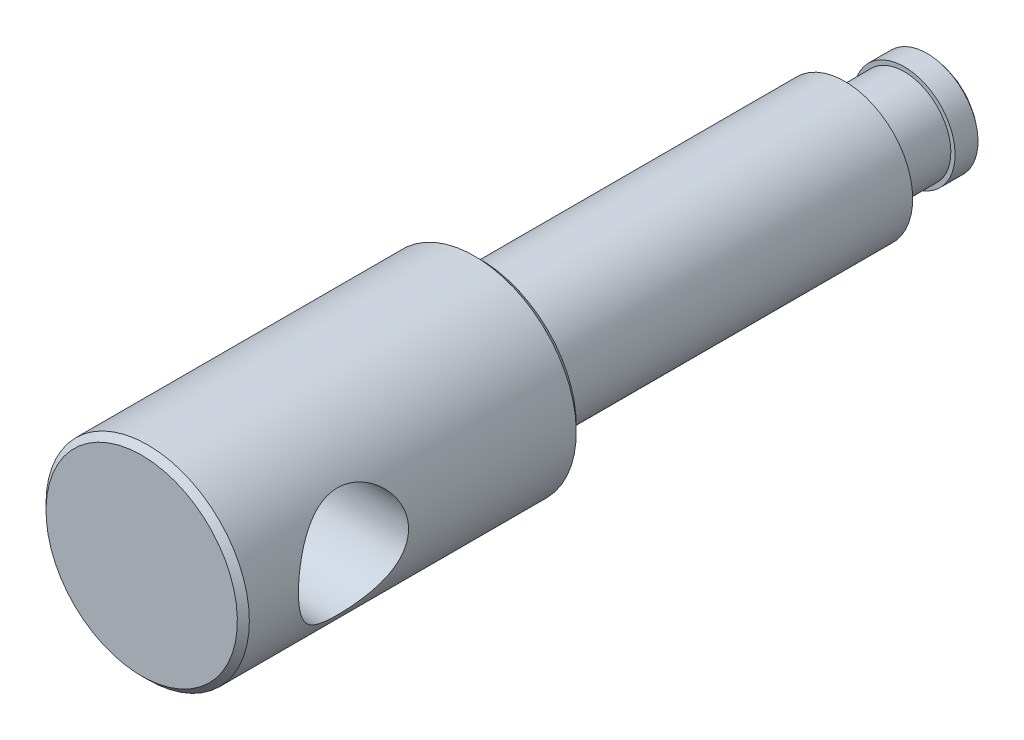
ISO-10303-21;
HEADER;
FILE_DESCRIPTION(('STEP AP214'),'2;1');
FILE_NAME('part.step','',(''),(''),'','','');
FILE_SCHEMA(('AUTOMOTIVE_DESIGN { 1 0 10303 214 1 1 1 1 }'));
ENDSEC;
DATA;
#1=APPLICATION_CONTEXT('core data for automotive mechanical design processes');
#2=APPLICATION_PROTOCOL_DEFINITION('international standard','automotive_design',2000,#1);
#3=PRODUCT_CONTEXT('',#1,'mechanical');
#4=PRODUCT('Part','Part','',(#3));
#5=PRODUCT_RELATED_PRODUCT_CATEGORY('part','',(#4));
#6=PRODUCT_DEFINITION_FORMATION('','',#4);
#7=PRODUCT_DEFINITION_CONTEXT('part definition',#1,'design');
#8=PRODUCT_DEFINITION('design','',#6,#7);
#9=PRODUCT_DEFINITION_SHAPE('','',#8);
#10=(LENGTH_UNIT() NAMED_UNIT(*) SI_UNIT(.MILLI.,.METRE.));
#11=(NAMED_UNIT(*) PLANE_ANGLE_UNIT() SI_UNIT($,.RADIAN.));
#12=(NAMED_UNIT(*) SI_UNIT($,.STERADIAN.) SOLID_ANGLE_UNIT());
#13=UNCERTAINTY_MEASURE_WITH_UNIT(LENGTH_MEASURE(1.E-05),#10,'distance_accuracy_value','');
#14=(GEOMETRIC_REPRESENTATION_CONTEXT(3) GLOBAL_UNCERTAINTY_ASSIGNED_CONTEXT((#13)) GLOBAL_UNIT_ASSIGNED_CONTEXT((#10,
#11,#12)) REPRESENTATION_CONTEXT('',''));
#15=CARTESIAN_POINT('',(0.,0.,0.));
#16=DIRECTION('',(0.,0.,1.));
#17=DIRECTION('',(1.,0.,0.));
#18=AXIS2_PLACEMENT_3D('',#15,#16,#17);
#19=CARTESIAN_POINT('',(0.,0.,9.));
#20=DIRECTION('',(-1.,0.,0.));
#21=DIRECTION('',(0.,1.,0.));
#22=AXIS2_PLACEMENT_3D('',#19,#20,#21);
#23=SPHERICAL_SURFACE('',#22,9.);
#24=CARTESIAN_POINT('',(0.,0.,2.29179606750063));
#25=DIRECTION('',(0.,0.,1.));
#26=DIRECTION('',(0.,-1.,0.));
#27=AXIS2_PLACEMENT_3D('',#24,#25,#26);
#28=CIRCLE('',#27,6.);
#29=CARTESIAN_POINT('',(0.,-6.,2.29179606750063));
#30=VERTEX_POINT('',#29);
#31=EDGE_CURVE('E112',#30,#30,#28,.T.);
#32=ORIENTED_EDGE('',*,*,#31,.F.);
#33=EDGE_LOOP('',(#32));
#34=FACE_BOUND('',#33,.T.);
#35=ADVANCED_FACE('F12',(#34),#23,.T.);
#36=CARTESIAN_POINT('',(0.,0.,0.));
#37=DIRECTION('',(0.,0.,1.));
#38=DIRECTION('',(0.,-1.,0.));
#39=AXIS2_PLACEMENT_3D('',#36,#37,#38);
#40=CYLINDRICAL_SURFACE('',#39,6.);
#41=CARTESIAN_POINT('',(0.,0.,5.));
#42=DIRECTION('',(0.,0.,1.));
#43=DIRECTION('',(0.,-1.,0.));
#44=AXIS2_PLACEMENT_3D('',#41,#42,#43);
#45=CIRCLE('',#44,6.);
#46=CARTESIAN_POINT('',(0.,-6.,5.));
#47=VERTEX_POINT('',#46);
#48=EDGE_CURVE('E113',#47,#47,#45,.F.);
#49=ORIENTED_EDGE('',*,*,#48,.T.);
#50=EDGE_LOOP('',(#49));
#51=FACE_BOUND('',#50,.T.);
#52=ORIENTED_EDGE('',*,*,#31,.T.);
#53=EDGE_LOOP('',(#52));
#54=FACE_BOUND('',#53,.T.);
#55=ADVANCED_FACE('F75',(#51,#54),#40,.T.);
#56=CARTESIAN_POINT('',(5.5,0.,5.));
#57=DIRECTION('',(0.,0.,-1.));
#58=DIRECTION('',(0.,1.,0.));
#59=AXIS2_PLACEMENT_3D('',#56,#57,#58);
#60=PLANE('',#59);
#61=CARTESIAN_POINT('',(0.,0.,5.));
#62=DIRECTION('',(0.,0.,1.));
#63=DIRECTION('',(0.,-1.,0.));
#64=AXIS2_PLACEMENT_3D('',#61,#62,#63);
#65=CIRCLE('',#64,5.5);
#66=CARTESIAN_POINT('',(0.,-5.5,5.));
#67=VERTEX_POINT('',#66);
#68=EDGE_CURVE('E94',#67,#67,#65,.T.);
#69=ORIENTED_EDGE('',*,*,#68,.F.);
#70=EDGE_LOOP('',(#69));
#71=FACE_BOUND('',#70,.T.);
#72=ORIENTED_EDGE('',*,*,#48,.F.);
#73=EDGE_LOOP('',(#72));
#74=FACE_BOUND('',#73,.T.);
#75=ADVANCED_FACE('F71',(#71,#74),#60,.F.);
#76=CARTESIAN_POINT('',(0.,0.,0.));
#77=DIRECTION('',(0.,0.,1.));
#78=DIRECTION('',(0.,-1.,0.));
#79=AXIS2_PLACEMENT_3D('',#76,#77,#78);
#80=CYLINDRICAL_SURFACE('',#79,5.5);
#81=CARTESIAN_POINT('',(0.,0.,10.5566243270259));
#82=DIRECTION('',(0.,0.,1.));
#83=DIRECTION('',(0.,-1.,0.));
#84=AXIS2_PLACEMENT_3D('',#81,#82,#83);
#85=CIRCLE('',#84,5.5);
#86=CARTESIAN_POINT('',(0.,-5.5,10.5566243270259));
#87=VERTEX_POINT('',#86);
#88=EDGE_CURVE('E90',#87,#87,#85,.T.);
#89=ORIENTED_EDGE('',*,*,#88,.F.);
#90=EDGE_LOOP('',(#89));
#91=FACE_BOUND('',#90,.T.);
#92=ORIENTED_EDGE('',*,*,#68,.T.);
#93=EDGE_LOOP('',(#92));
#94=FACE_BOUND('',#93,.T.);
#95=ADVANCED_FACE('F67',(#91,#94),#80,.T.);
#96=CARTESIAN_POINT('',(0.,0.,12.));
#97=DIRECTION('',(0.,0.,1.));
#98=DIRECTION('',(0.,-1.,0.));
#99=AXIS2_PLACEMENT_3D('',#96,#97,#98);
#100=CONICAL_SURFACE('',#99,8.,1.0471975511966);
#101=CARTESIAN_POINT('',(0.,0.,12.));
#102=DIRECTION('',(0.,0.,1.));
#103=DIRECTION('',(0.,-1.,0.));
#104=AXIS2_PLACEMENT_3D('',#101,#102,#103);
#105=CIRCLE('',#104,8.);
#106=CARTESIAN_POINT('',(0.,-8.,12.));
#107=VERTEX_POINT('',#106);
#108=EDGE_CURVE('E97',#107,#107,#105,.T.);
#109=ORIENTED_EDGE('',*,*,#108,.F.);
#110=EDGE_LOOP('',(#109));
#111=FACE_BOUND('',#110,.T.);
#112=ORIENTED_EDGE('',*,*,#88,.T.);
#113=EDGE_LOOP('',(#112));
#114=FACE_BOUND('',#113,.T.);
#115=ADVANCED_FACE('F63',(#111,#114),#100,.T.);
#116=CARTESIAN_POINT('',(0.,0.,0.));
#117=DIRECTION('',(0.,0.,1.));
#118=DIRECTION('',(0.,-1.,0.));
#119=AXIS2_PLACEMENT_3D('',#116,#117,#118);
#120=CYLINDRICAL_SURFACE('',#119,8.);
#121=CARTESIAN_POINT('',(0.,0.,55.));
#122=DIRECTION('',(0.,0.,1.));
#123=DIRECTION('',(0.,-1.,0.));
#124=AXIS2_PLACEMENT_3D('',#121,#122,#123);
#125=CIRCLE('',#124,8.);
#126=CARTESIAN_POINT('',(0.,-8.,55.));
#127=VERTEX_POINT('',#126);
#128=EDGE_CURVE('E93',#127,#127,#125,.F.);
#129=ORIENTED_EDGE('',*,*,#128,.T.);
#130=EDGE_LOOP('',(#129));
#131=FACE_BOUND('',#130,.T.);
#132=ORIENTED_EDGE('',*,*,#108,.T.);
#133=EDGE_LOOP('',(#132));
#134=FACE_BOUND('',#133,.T.);
#135=ADVANCED_FACE('F59',(#131,#134),#120,.T.);
#136=CARTESIAN_POINT('',(11.2928932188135,0.,55.));
#137=DIRECTION('',(0.,0.,1.));
#138=DIRECTION('',(0.,-1.,0.));
#139=AXIS2_PLACEMENT_3D('',#136,#137,#138);
#140=PLANE('',#139);
#141=CARTESIAN_POINT('',(0.,0.,55.));
#142=DIRECTION('',(0.,0.,1.));
#143=DIRECTION('',(0.,-1.,0.));
#144=AXIS2_PLACEMENT_3D('',#141,#142,#143);
#145=CIRCLE('',#144,11.2928932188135);
#146=CARTESIAN_POINT('',(0.,-11.2928932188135,55.));
#147=VERTEX_POINT('',#146);
#148=EDGE_CURVE('E100',#147,#147,#145,.T.);
#149=ORIENTED_EDGE('',*,*,#148,.F.);
#150=EDGE_LOOP('',(#149));
#151=FACE_BOUND('',#150,.T.);
#152=ORIENTED_EDGE('',*,*,#128,.F.);
#153=EDGE_LOOP('',(#152));
#154=FACE_BOUND('',#153,.T.);
#155=ADVANCED_FACE('F55',(#151,#154),#140,.F.);
#156=CARTESIAN_POINT('',(0.,0.,95.));
#157=DIRECTION('',(0.,0.,-1.));
#158=DIRECTION('',(0.,1.,0.));
#159=AXIS2_PLACEMENT_3D('',#156,#157,#158);
#160=PLANE('',#159);
#161=CARTESIAN_POINT('',(0.,0.,95.));
#162=DIRECTION('',(0.,0.,-1.));
#163=DIRECTION('',(0.,1.,0.));
#164=AXIS2_PLACEMENT_3D('',#161,#162,#163);
#165=CIRCLE('',#164,11.2928932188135);
#166=CARTESIAN_POINT('',(0.,11.2928932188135,95.));
#167=VERTEX_POINT('',#166);
#168=EDGE_CURVE('E86',#167,#167,#165,.T.);
#169=ORIENTED_EDGE('',*,*,#168,.F.);
#170=EDGE_LOOP('',(#169));
#171=FACE_BOUND('',#170,.T.);
#172=ADVANCED_FACE('F51',(#171),#160,.F.);
#173=CARTESIAN_POINT('',(0.,0.,55.7071067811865));
#174=DIRECTION('',(0.,0.,1.));
#175=DIRECTION('',(0.,-1.,0.));
#176=AXIS2_PLACEMENT_3D('',#173,#174,#175);
#177=CONICAL_SURFACE('',#176,12.,0.785398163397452);
#178=CARTESIAN_POINT('',(0.,0.,55.7071067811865));
#179=DIRECTION('',(0.,0.,1.));
#180=DIRECTION('',(0.,-1.,0.));
#181=AXIS2_PLACEMENT_3D('',#178,#179,#180);
#182=CIRCLE('',#181,12.);
#183=CARTESIAN_POINT('',(0.,-12.,55.7071067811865));
#184=VERTEX_POINT('',#183);
#185=EDGE_CURVE('E27',#184,#184,#182,.T.);
#186=ORIENTED_EDGE('',*,*,#185,.F.);
#187=EDGE_LOOP('',(#186));
#188=FACE_BOUND('',#187,.T.);
#189=ORIENTED_EDGE('',*,*,#148,.T.);
#190=EDGE_LOOP('',(#189));
#191=FACE_BOUND('',#190,.T.);
#192=ADVANCED_FACE('F47',(#188,#191),#177,.T.);
#193=CARTESIAN_POINT('',(0.,0.,94.2928932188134));
#194=DIRECTION('',(0.,0.,-1.));
#195=DIRECTION('',(0.,1.,0.));
#196=AXIS2_PLACEMENT_3D('',#193,#194,#195);
#197=CONICAL_SURFACE('',#196,12.,0.78539816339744);
#198=ORIENTED_EDGE('',*,*,#168,.T.);
#199=EDGE_LOOP('',(#198));
#200=FACE_BOUND('',#199,.T.);
#201=CARTESIAN_POINT('',(0.,0.,94.2928932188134));
#202=DIRECTION('',(0.,0.,1.));
#203=DIRECTION('',(0.,-1.,0.));
#204=AXIS2_PLACEMENT_3D('',#201,#202,#203);
#205=CIRCLE('',#204,12.);
#206=CARTESIAN_POINT('',(0.,-12.,94.2928932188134));
#207=VERTEX_POINT('',#206);
#208=EDGE_CURVE('E31',#207,#207,#205,.F.);
#209=ORIENTED_EDGE('',*,*,#208,.F.);
#210=EDGE_LOOP('',(#209));
#211=FACE_BOUND('',#210,.T.);
#212=ADVANCED_FACE('F42',(#200,#211),#197,.T.);
#213=CARTESIAN_POINT('',(0.,0.,0.));
#214=DIRECTION('',(0.,0.,1.));
#215=DIRECTION('',(0.,-1.,0.));
#216=AXIS2_PLACEMENT_3D('',#213,#214,#215);
#217=CYLINDRICAL_SURFACE('',#216,12.);
#218=CARTESIAN_POINT('',(-10.087120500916,6.5,82.));
#219=CARTESIAN_POINT('',(-10.087118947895,6.50000119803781,81.8328756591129));
#220=CARTESIAN_POINT('',(-10.0912874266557,6.49354678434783,81.6657648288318));
#221=CARTESIAN_POINT('',(-10.1077896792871,6.46782984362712,81.3328781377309));
#222=CARTESIAN_POINT('',(-10.1201263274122,6.44856280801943,81.1671027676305));
#223=CARTESIAN_POINT('',(-10.1524999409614,6.39747254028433,80.8380599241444));
#224=CARTESIAN_POINT('',(-10.1725465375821,6.36563360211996,80.6747958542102));
#225=CARTESIAN_POINT('',(-10.2195968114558,6.28981935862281,80.3520727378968));
#226=CARTESIAN_POINT('',(-10.2466035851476,6.24583865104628,80.1926154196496));
#227=CARTESIAN_POINT('',(-10.3064421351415,6.14659096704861,79.8795748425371));
#228=CARTESIAN_POINT('',(-10.3392345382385,6.09139991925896,79.7259599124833));
#229=CARTESIAN_POINT('',(-10.4097518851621,5.97009096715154,79.4242527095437));
#230=CARTESIAN_POINT('',(-10.4474786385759,5.9039690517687,79.2761624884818));
#231=CARTESIAN_POINT('',(-10.5664492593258,5.69005888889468,78.8412761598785));
#232=CARTESIAN_POINT('',(-10.6535335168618,5.52664700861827,78.5636176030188));
#233=CARTESIAN_POINT('',(-10.8437484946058,5.14421208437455,78.0111716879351));
#234=CARTESIAN_POINT('',(-10.9476156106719,4.9213132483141,77.7393209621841));
#235=CARTESIAN_POINT('',(-11.1021466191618,4.55630390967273,77.3609403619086));
#236=CARTESIAN_POINT('',(-11.1534773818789,4.42943405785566,77.2396454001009));
#237=CARTESIAN_POINT('',(-11.2545668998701,4.16588742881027,77.0073833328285));
#238=CARTESIAN_POINT('',(-11.3043253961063,4.02920904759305,76.8964179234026));
#239=CARTESIAN_POINT('',(-11.4051037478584,3.73493814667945,76.676778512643));
#240=CARTESIAN_POINT('',(-11.4558859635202,3.57655121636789,76.5690577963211));
#241=CARTESIAN_POINT('',(-11.5527965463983,3.24990680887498,76.3675127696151));
#242=CARTESIAN_POINT('',(-11.5989269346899,3.08165366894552,76.2736824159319));
#243=CARTESIAN_POINT('',(-11.6852214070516,2.7362872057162,76.100847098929));
#244=CARTESIAN_POINT('',(-11.725387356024,2.55917667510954,76.0218374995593));
#245=CARTESIAN_POINT('',(-11.798554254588,2.19731059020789,75.8795746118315));
#246=CARTESIAN_POINT('',(-11.8315561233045,2.01255602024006,75.8163193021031));
#247=CARTESIAN_POINT('',(-11.8870041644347,1.65215873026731,75.7109056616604));
#248=CARTESIAN_POINT('',(-11.9100894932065,1.47699280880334,75.6674520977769));
#249=CARTESIAN_POINT('',(-11.9486794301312,1.12284285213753,75.5951676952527));
#250=CARTESIAN_POINT('',(-11.9641844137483,0.94385900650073,75.566336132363));
#251=CARTESIAN_POINT('',(-11.9871526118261,0.583705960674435,75.5237240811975));
#252=CARTESIAN_POINT('',(-11.9946207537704,0.402538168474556,75.5099343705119));
#253=CARTESIAN_POINT('',(-12.0013074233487,0.0395375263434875,75.497584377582));
#254=CARTESIAN_POINT('',(-12.0005265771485,-0.142295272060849,75.499022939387));
#255=CARTESIAN_POINT('',(-11.9912428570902,-0.486463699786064,75.5161781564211));
#256=CARTESIAN_POINT('',(-11.9835355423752,-0.648896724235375,75.5304238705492));
#257=CARTESIAN_POINT('',(-11.9616756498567,-0.971862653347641,75.5710049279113));
#258=CARTESIAN_POINT('',(-11.94752092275,-1.13239490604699,75.5973443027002));
#259=CARTESIAN_POINT('',(-11.913104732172,-1.45034460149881,75.6617979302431));
#260=CARTESIAN_POINT('',(-11.8928454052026,-1.60776311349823,75.6999080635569));
#261=CARTESIAN_POINT('',(-11.8466723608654,-1.91860842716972,75.7875101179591));
#262=CARTESIAN_POINT('',(-11.820756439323,-2.07203364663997,75.8370064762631));
#263=CARTESIAN_POINT('',(-11.763526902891,-2.37561538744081,75.9474943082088));
#264=CARTESIAN_POINT('',(-11.7321572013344,-2.52571759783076,76.0086059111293));
#265=CARTESIAN_POINT('',(-11.6648916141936,-2.82013189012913,76.1414196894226));
#266=CARTESIAN_POINT('',(-11.6289942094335,-2.96444200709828,76.2131254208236));
#267=CARTESIAN_POINT('',(-11.5156109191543,-3.38759543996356,76.4432730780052));
#268=CARTESIAN_POINT('',(-11.4323975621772,-3.65684755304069,76.6168137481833));
#269=CARTESIAN_POINT('',(-11.2478649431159,-4.19213402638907,77.0200480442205));
#270=CARTESIAN_POINT('',(-11.1455615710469,-4.45481814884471,77.2537387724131));
#271=CARTESIAN_POINT('',(-10.9911490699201,-4.81788921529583,77.6332291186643));
#272=CARTESIAN_POINT('',(-10.9394753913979,-4.933837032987,77.7646727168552));
#273=CARTESIAN_POINT('',(-10.8370351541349,-5.15494824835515,78.0367657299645));
#274=CARTESIAN_POINT('',(-10.7862687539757,-5.26010977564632,78.1774167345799));
#275=CARTESIAN_POINT('',(-10.6828047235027,-5.46737700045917,78.4794745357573));
#276=CARTESIAN_POINT('',(-10.6303021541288,-5.56848689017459,78.6416327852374));
#277=CARTESIAN_POINT('',(-10.5296797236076,-5.75649288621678,78.9751992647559));
#278=CARTESIAN_POINT('',(-10.4815578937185,-5.84339539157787,79.1466032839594));
#279=CARTESIAN_POINT('',(-10.3914773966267,-6.00212687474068,79.4976892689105));
#280=CARTESIAN_POINT('',(-10.349514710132,-6.07396569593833,79.677365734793));
#281=CARTESIAN_POINT('',(-10.2734696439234,-6.20172232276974,80.0439097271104));
#282=CARTESIAN_POINT('',(-10.2393860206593,-6.25764264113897,80.2307761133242));
#283=CARTESIAN_POINT('',(-10.183067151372,-6.34884087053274,80.5948225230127));
#284=CARTESIAN_POINT('',(-10.1600959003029,-6.38542375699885,80.7715614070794));
#285=CARTESIAN_POINT('',(-10.1231525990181,-6.44383305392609,81.1283981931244));
#286=CARTESIAN_POINT('',(-10.1091799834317,-6.46566039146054,81.3084958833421));
#287=CARTESIAN_POINT('',(-10.0908950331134,-6.49416095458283,81.67021537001));
#288=CARTESIAN_POINT('',(-10.0865740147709,-6.50084780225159,81.8518356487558));
#289=CARTESIAN_POINT('',(-10.0877775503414,-6.49898061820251,82.2149553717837));
#290=CARTESIAN_POINT('',(-10.0933011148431,-6.49042811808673,82.3964548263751));
#291=CARTESIAN_POINT('',(-10.1124808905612,-6.46049409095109,82.7323705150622));
#292=CARTESIAN_POINT('',(-10.1248969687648,-6.44106571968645,82.8870373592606));
#293=CARTESIAN_POINT('',(-10.1563891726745,-6.39129308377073,83.193964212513));
#294=CARTESIAN_POINT('',(-10.1754674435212,-6.36094530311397,83.3462234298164));
#295=CARTESIAN_POINT('',(-10.2196651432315,-6.28968973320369,83.6473418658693));
#296=CARTESIAN_POINT('',(-10.24478424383,-6.24878251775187,83.796201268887));
#297=CARTESIAN_POINT('',(-10.3003063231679,-6.15683127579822,84.0897666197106));
#298=CARTESIAN_POINT('',(-10.3307114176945,-6.10578318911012,84.2344708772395));
#299=CARTESIAN_POINT('',(-10.4314159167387,-5.93327889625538,84.6735187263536));
#300=CARTESIAN_POINT('',(-10.5092162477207,-5.79551066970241,84.9599297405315));
#301=CARTESIAN_POINT('',(-10.6762160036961,-5.48178778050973,85.5071051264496));
#302=CARTESIAN_POINT('',(-10.7654211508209,-5.30581391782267,85.7678565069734));
#303=CARTESIAN_POINT('',(-10.9615933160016,-4.88917754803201,86.2983926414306));
#304=CARTESIAN_POINT('',(-11.0691920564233,-4.64273975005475,86.5634731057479));
#305=CARTESIAN_POINT('',(-11.2261517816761,-4.24196259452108,86.9283374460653));
#306=CARTESIAN_POINT('',(-11.2777643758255,-4.10308206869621,87.0445650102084));
#307=CARTESIAN_POINT('',(-11.378301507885,-3.81542023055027,87.2654942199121));
#308=CARTESIAN_POINT('',(-11.427225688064,-3.66663760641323,87.3701943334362));
#309=CARTESIAN_POINT('',(-11.5233155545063,-3.35281482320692,87.5718054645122));
#310=CARTESIAN_POINT('',(-11.5702947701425,-3.18734081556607,87.6681309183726));
#311=CARTESIAN_POINT('',(-11.6586044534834,-2.84741194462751,87.8462843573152));
#312=CARTESIAN_POINT('',(-11.699937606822,-2.67296140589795,87.9281192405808));
#313=CARTESIAN_POINT('',(-11.7757388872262,-2.3162883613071,88.0763543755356));
#314=CARTESIAN_POINT('',(-11.8102108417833,-2.13407025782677,88.1427632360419));
#315=CARTESIAN_POINT('',(-11.8712409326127,-1.76321621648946,88.2592994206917));
#316=CARTESIAN_POINT('',(-11.897800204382,-1.57458120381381,88.3094290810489));
#317=CARTESIAN_POINT('',(-11.9399132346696,-1.21177627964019,88.3884682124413));
#318=CARTESIAN_POINT('',(-11.9563044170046,-1.03805633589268,88.4190032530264));
#319=CARTESIAN_POINT('',(-11.9815348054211,-0.688168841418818,88.4658772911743));
#320=CARTESIAN_POINT('',(-11.9903745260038,-0.51200145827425,88.4822172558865));
#321=CARTESIAN_POINT('',(-12.0002498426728,-0.158776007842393,88.500465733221));
#322=CARTESIAN_POINT('',(-12.0012886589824,0.018281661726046,88.502380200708));
#323=CARTESIAN_POINT('',(-11.9955405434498,0.371831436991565,88.4917650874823));
#324=CARTESIAN_POINT('',(-11.9887539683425,0.548323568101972,88.4792361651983));
#325=CARTESIAN_POINT('',(-11.9684587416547,0.884220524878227,88.4416014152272));
#326=CARTESIAN_POINT('',(-11.955574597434,1.04379585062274,88.4176627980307));
#327=CARTESIAN_POINT('',(-11.9237226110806,1.36019350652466,88.3581281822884));
#328=CARTESIAN_POINT('',(-11.9047527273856,1.51701489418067,88.3225282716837));
#329=CARTESIAN_POINT('',(-11.8611656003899,1.82680418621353,88.2400699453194));
#330=CARTESIAN_POINT('',(-11.8365501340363,1.97977328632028,88.1932150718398));
#331=CARTESIAN_POINT('',(-11.7821936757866,2.28108822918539,88.0886845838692));
#332=CARTESIAN_POINT('',(-11.7524506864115,2.42943224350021,88.0310047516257));
#333=CARTESIAN_POINT('',(-11.6873202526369,2.72587240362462,87.9031003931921));
#334=CARTESIAN_POINT('',(-11.6517694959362,2.87377152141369,87.8325022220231));
#335=CARTESIAN_POINT('',(-11.5765941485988,3.16304240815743,87.680832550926));
#336=CARTESIAN_POINT('',(-11.5369681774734,3.30441194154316,87.5997574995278));
#337=CARTESIAN_POINT('',(-11.4131894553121,3.71775123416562,87.341701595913));
#338=CARTESIAN_POINT('',(-11.324101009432,3.97910456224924,87.1498234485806));
#339=CARTESIAN_POINT('',(-11.1293540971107,4.49693418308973,86.7070572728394));
#340=CARTESIAN_POINT('',(-11.0229598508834,4.74953907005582,86.4519553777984));
#341=CARTESIAN_POINT('',(-10.865503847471,5.09479556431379,86.0404485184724));
#342=CARTESIAN_POINT('',(-10.8133263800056,5.20435968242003,85.8983233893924));
#343=CARTESIAN_POINT('',(-10.7110504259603,5.41172260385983,85.6049290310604));
#344=CARTESIAN_POINT('',(-10.6609522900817,5.50951942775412,85.4536582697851));
#345=CARTESIAN_POINT('',(-10.561377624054,5.69819013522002,85.1332504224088));
#346=CARTESIAN_POINT('',(-10.512122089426,5.78828717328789,84.963586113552));
#347=CARTESIAN_POINT('',(-10.4194004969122,5.95357648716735,84.6157183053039));
#348=CARTESIAN_POINT('',(-10.3759314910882,6.02877636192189,84.4375192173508));
#349=CARTESIAN_POINT('',(-10.2966205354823,6.16325352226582,84.0740667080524));
#350=CARTESIAN_POINT('',(-10.2607600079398,6.22256968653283,83.8888318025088));
#351=CARTESIAN_POINT('',(-10.1981899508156,6.324595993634,83.5124375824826));
#352=CARTESIAN_POINT('',(-10.1714744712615,6.36731693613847,83.3212822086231));
#353=CARTESIAN_POINT('',(-10.1293959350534,6.43403702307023,82.9426526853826));
#354=CARTESIAN_POINT('',(-10.1136130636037,6.45873074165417,82.7553479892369));
#355=CARTESIAN_POINT('',(-10.0924761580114,6.49171165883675,82.3786897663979));
#356=CARTESIAN_POINT('',(-10.0871222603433,6.49999864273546,82.1893362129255));
#357=CARTESIAN_POINT('',(-10.087120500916,6.5,82.));
#358=B_SPLINE_CURVE_WITH_KNOTS('',3,(#218,#219,#220,#221,#222,#223,#224,#225,#226,#227,#228,
#229,#230,#231,#232,#233,#234,#235,#236,#237,#238,#239,#240,#241,#242,#243,#244,#245,#246,#247,
#248,#249,#250,#251,#252,#253,#254,#255,#256,#257,#258,#259,#260,#261,#262,#263,#264,#265,#266,
#267,#268,#269,#270,#271,#272,#273,#274,#275,#276,#277,#278,#279,#280,#281,#282,#283,#284,#285,
#286,#287,#288,#289,#290,#291,#292,#293,#294,#295,#296,#297,#298,#299,#300,#301,#302,#303,#304,
#305,#306,#307,#308,#309,#310,#311,#312,#313,#314,#315,#316,#317,#318,#319,#320,#321,#322,#323,
#324,#325,#326,#327,#328,#329,#330,#331,#332,#333,#334,#335,#336,#337,#338,#339,#340,#341,#342,
#343,#344,#345,#346,#347,#348,#349,#350,#351,#352,#353,#354,#355,#356,#357),.UNSPECIFIED.,.T.,
.F.,(4,2,2,2,2,2,2,2,2,2,2,2,2,2,2,2,2,2,2,2,2,2,2,2,2,2,2,2,2,2,2,2,2,2,2,2,2,2,2,2,2,2,2,2,2,
2,2,2,2,2,2,2,2,2,2,2,2,2,2,2,2,2,2,2,2,2,2,2,2,4),(0.,0.501175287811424,1.00252702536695,
1.50450709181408,2.00671086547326,2.50562026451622,3.00471314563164,4.0021156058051,
5.09706524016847,5.64523335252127,6.19349131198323,6.78721913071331,7.38068787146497,
7.97397065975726,8.56717728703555,9.11225779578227,9.65731130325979,10.2020304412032,
10.7467082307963,11.2358435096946,11.7251419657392,12.2142693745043,12.7035877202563,
13.1982731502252,13.6931250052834,14.6822316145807,15.7759181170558,16.3236710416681,
16.8715187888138,17.4653089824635,18.0588309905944,18.6519639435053,19.2450032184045,
19.7900148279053,20.3349921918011,20.8794790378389,21.423911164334,21.8924997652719,
22.3612393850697,22.8299535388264,23.2988557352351,24.2763506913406,25.2543380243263,
26.3817148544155,26.9461447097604,27.5106494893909,28.1013064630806,28.6916814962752,
29.2817262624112,29.8716863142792,30.4023944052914,30.9330663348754,31.4635191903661,
31.9939478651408,32.4790142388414,32.9642435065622,33.449320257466,33.9345864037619,
34.4371369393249,34.9398582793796,35.944795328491,37.0630240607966,37.6231922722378,
38.1834545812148,38.7776141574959,39.3714698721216,39.9638584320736,40.5558608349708,
41.123638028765,41.6914226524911),.UNSPECIFIED.);
#359=CARTESIAN_POINT('',(-10.087120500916,6.5,82.));
#360=VERTEX_POINT('',#359);
#361=EDGE_CURVE('E23',#360,#360,#358,.T.);
#362=ORIENTED_EDGE('',*,*,#361,.F.);
#363=EDGE_LOOP('',(#362));
#364=FACE_BOUND('',#363,.T.);
#365=ORIENTED_EDGE('',*,*,#208,.T.);
#366=EDGE_LOOP('',(#365));
#367=FACE_BOUND('',#366,.T.);
#368=CARTESIAN_POINT('',(10.087120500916,6.5,82.));
#369=CARTESIAN_POINT('',(10.087118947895,6.50000119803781,82.1671243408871));
#370=CARTESIAN_POINT('',(10.0912874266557,6.49354678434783,82.3342351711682));
#371=CARTESIAN_POINT('',(10.1077896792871,6.46782984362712,82.6671218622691));
#372=CARTESIAN_POINT('',(10.1201263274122,6.44856280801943,82.8328972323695));
#373=CARTESIAN_POINT('',(10.1524999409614,6.39747254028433,83.1619400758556));
#374=CARTESIAN_POINT('',(10.1725465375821,6.36563360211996,83.3252041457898));
#375=CARTESIAN_POINT('',(10.2195968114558,6.28981935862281,83.6479272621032));
#376=CARTESIAN_POINT('',(10.2466035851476,6.24583865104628,83.8073845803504));
#377=CARTESIAN_POINT('',(10.3064421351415,6.14659096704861,84.1204251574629));
#378=CARTESIAN_POINT('',(10.3392345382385,6.09139991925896,84.2740400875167));
#379=CARTESIAN_POINT('',(10.4097518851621,5.97009096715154,84.5757472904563));
#380=CARTESIAN_POINT('',(10.4474786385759,5.9039690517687,84.7238375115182));
#381=CARTESIAN_POINT('',(10.5664492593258,5.69005888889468,85.1587238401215));
#382=CARTESIAN_POINT('',(10.6535335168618,5.52664700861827,85.4363823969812));
#383=CARTESIAN_POINT('',(10.8437484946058,5.14421208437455,85.9888283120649));
#384=CARTESIAN_POINT('',(10.9476156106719,4.9213132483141,86.2606790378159));
#385=CARTESIAN_POINT('',(11.1021466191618,4.55630390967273,86.6390596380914));
#386=CARTESIAN_POINT('',(11.1534773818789,4.42943405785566,86.7603545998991));
#387=CARTESIAN_POINT('',(11.2545668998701,4.16588742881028,86.9926166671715));
#388=CARTESIAN_POINT('',(11.3043253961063,4.02920904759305,87.1035820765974));
#389=CARTESIAN_POINT('',(11.4051037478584,3.73493814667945,87.323221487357));
#390=CARTESIAN_POINT('',(11.4558859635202,3.57655121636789,87.4309422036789));
#391=CARTESIAN_POINT('',(11.5527965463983,3.24990680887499,87.6324872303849));
#392=CARTESIAN_POINT('',(11.5989269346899,3.08165366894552,87.7263175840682));
#393=CARTESIAN_POINT('',(11.6852214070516,2.7362872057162,87.899152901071));
#394=CARTESIAN_POINT('',(11.725387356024,2.55917667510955,87.9781625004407));
#395=CARTESIAN_POINT('',(11.798554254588,2.1973105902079,88.1204253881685));
#396=CARTESIAN_POINT('',(11.8315561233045,2.01255602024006,88.1836806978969));
#397=CARTESIAN_POINT('',(11.8870041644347,1.65215873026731,88.2890943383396));
#398=CARTESIAN_POINT('',(11.9100894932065,1.47699280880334,88.3325479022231));
#399=CARTESIAN_POINT('',(11.9486794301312,1.12284285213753,88.4048323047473));
#400=CARTESIAN_POINT('',(11.9641844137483,0.943859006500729,88.433663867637));
#401=CARTESIAN_POINT('',(11.9871526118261,0.583705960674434,88.4762759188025));
#402=CARTESIAN_POINT('',(11.9946207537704,0.402538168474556,88.4900656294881));
#403=CARTESIAN_POINT('',(12.0013074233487,0.0395375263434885,88.502415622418));
#404=CARTESIAN_POINT('',(12.0005265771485,-0.142295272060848,88.500977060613));
#405=CARTESIAN_POINT('',(11.9912428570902,-0.486463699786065,88.4838218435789));
#406=CARTESIAN_POINT('',(11.9835355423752,-0.648896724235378,88.4695761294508));
#407=CARTESIAN_POINT('',(11.9616756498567,-0.971862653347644,88.4289950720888));
#408=CARTESIAN_POINT('',(11.94752092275,-1.13239490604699,88.4026556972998));
#409=CARTESIAN_POINT('',(11.913104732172,-1.45034460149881,88.3382020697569));
#410=CARTESIAN_POINT('',(11.8928454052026,-1.60776311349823,88.3000919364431));
#411=CARTESIAN_POINT('',(11.8466723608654,-1.91860842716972,88.2124898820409));
#412=CARTESIAN_POINT('',(11.820756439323,-2.07203364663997,88.1629935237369));
#413=CARTESIAN_POINT('',(11.763526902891,-2.37561538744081,88.0525056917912));
#414=CARTESIAN_POINT('',(11.7321572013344,-2.52571759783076,87.9913940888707));
#415=CARTESIAN_POINT('',(11.6648916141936,-2.82013189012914,87.8585803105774));
#416=CARTESIAN_POINT('',(11.6289942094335,-2.96444200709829,87.7868745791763));
#417=CARTESIAN_POINT('',(11.5156109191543,-3.38759543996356,87.5567269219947));
#418=CARTESIAN_POINT('',(11.4323975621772,-3.65684755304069,87.3831862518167));
#419=CARTESIAN_POINT('',(11.2478649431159,-4.19213402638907,86.9799519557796));
#420=CARTESIAN_POINT('',(11.1455615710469,-4.45481814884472,86.7462612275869));
#421=CARTESIAN_POINT('',(10.9911490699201,-4.81788921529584,86.3667708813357));
#422=CARTESIAN_POINT('',(10.9394753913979,-4.933837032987,86.2353272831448));
#423=CARTESIAN_POINT('',(10.8370351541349,-5.15494824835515,85.9632342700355));
#424=CARTESIAN_POINT('',(10.7862687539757,-5.26010977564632,85.8225832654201));
#425=CARTESIAN_POINT('',(10.6828047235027,-5.46737700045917,85.5205254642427));
#426=CARTESIAN_POINT('',(10.6303021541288,-5.56848689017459,85.3583672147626));
#427=CARTESIAN_POINT('',(10.5296797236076,-5.75649288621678,85.0248007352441));
#428=CARTESIAN_POINT('',(10.4815578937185,-5.84339539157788,84.8533967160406));
#429=CARTESIAN_POINT('',(10.3914773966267,-6.00212687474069,84.5023107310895));
#430=CARTESIAN_POINT('',(10.349514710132,-6.07396569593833,84.3226342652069));
#431=CARTESIAN_POINT('',(10.2734696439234,-6.20172232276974,83.9560902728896));
#432=CARTESIAN_POINT('',(10.2393860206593,-6.25764264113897,83.7692238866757));
#433=CARTESIAN_POINT('',(10.183067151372,-6.34884087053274,83.4051774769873));
#434=CARTESIAN_POINT('',(10.1600959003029,-6.38542375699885,83.2284385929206));
#435=CARTESIAN_POINT('',(10.1231525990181,-6.44383305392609,82.8716018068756));
#436=CARTESIAN_POINT('',(10.1091799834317,-6.46566039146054,82.6915041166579));
#437=CARTESIAN_POINT('',(10.0908950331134,-6.49416095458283,82.32978462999));
#438=CARTESIAN_POINT('',(10.0865740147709,-6.50084780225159,82.1481643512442));
#439=CARTESIAN_POINT('',(10.0877775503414,-6.49898061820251,81.7850446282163));
#440=CARTESIAN_POINT('',(10.0933011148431,-6.49042811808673,81.6035451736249));
#441=CARTESIAN_POINT('',(10.1124808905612,-6.46049409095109,81.2676294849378));
#442=CARTESIAN_POINT('',(10.1248969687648,-6.44106571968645,81.1129626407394));
#443=CARTESIAN_POINT('',(10.1563891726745,-6.39129308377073,80.806035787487));
#444=CARTESIAN_POINT('',(10.1754674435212,-6.36094530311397,80.6537765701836));
#445=CARTESIAN_POINT('',(10.2196651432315,-6.28968973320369,80.3526581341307));
#446=CARTESIAN_POINT('',(10.24478424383,-6.24878251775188,80.203798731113));
#447=CARTESIAN_POINT('',(10.3003063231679,-6.15683127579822,79.9102333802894));
#448=CARTESIAN_POINT('',(10.3307114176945,-6.10578318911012,79.7655291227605));
#449=CARTESIAN_POINT('',(10.4314159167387,-5.93327889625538,79.3264812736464));
#450=CARTESIAN_POINT('',(10.5092162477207,-5.79551066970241,79.0400702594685));
#451=CARTESIAN_POINT('',(10.6762160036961,-5.48178778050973,78.4928948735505));
#452=CARTESIAN_POINT('',(10.7654211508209,-5.30581391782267,78.2321434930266));
#453=CARTESIAN_POINT('',(10.9615933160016,-4.88917754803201,77.7016073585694));
#454=CARTESIAN_POINT('',(11.0691920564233,-4.64273975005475,77.4365268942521));
#455=CARTESIAN_POINT('',(11.2261517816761,-4.24196259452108,77.0716625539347));
#456=CARTESIAN_POINT('',(11.2777643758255,-4.10308206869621,76.9554349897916));
#457=CARTESIAN_POINT('',(11.378301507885,-3.81542023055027,76.7345057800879));
#458=CARTESIAN_POINT('',(11.427225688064,-3.66663760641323,76.6298056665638));
#459=CARTESIAN_POINT('',(11.5233155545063,-3.35281482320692,76.4281945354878));
#460=CARTESIAN_POINT('',(11.5702947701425,-3.18734081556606,76.3318690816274));
#461=CARTESIAN_POINT('',(11.6586044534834,-2.8474119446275,76.1537156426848));
#462=CARTESIAN_POINT('',(11.699937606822,-2.67296140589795,76.0718807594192));
#463=CARTESIAN_POINT('',(11.7757388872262,-2.3162883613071,75.9236456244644));
#464=CARTESIAN_POINT('',(11.8102108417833,-2.13407025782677,75.8572367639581));
#465=CARTESIAN_POINT('',(11.8712409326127,-1.76321621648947,75.7407005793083));
#466=CARTESIAN_POINT('',(11.897800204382,-1.57458120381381,75.6905709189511));
#467=CARTESIAN_POINT('',(11.9399132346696,-1.21177627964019,75.6115317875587));
#468=CARTESIAN_POINT('',(11.9563044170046,-1.03805633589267,75.5809967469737));
#469=CARTESIAN_POINT('',(11.9815348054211,-0.688168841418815,75.5341227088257));
#470=CARTESIAN_POINT('',(11.9903745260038,-0.512001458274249,75.5177827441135));
#471=CARTESIAN_POINT('',(12.0002498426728,-0.158776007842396,75.499534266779));
#472=CARTESIAN_POINT('',(12.0012886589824,0.0182816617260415,75.497619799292));
#473=CARTESIAN_POINT('',(11.9955405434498,0.371831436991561,75.5082349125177));
#474=CARTESIAN_POINT('',(11.9887539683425,0.548323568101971,75.5207638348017));
#475=CARTESIAN_POINT('',(11.9684587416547,0.884220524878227,75.5583985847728));
#476=CARTESIAN_POINT('',(11.955574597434,1.04379585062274,75.5823372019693));
#477=CARTESIAN_POINT('',(11.9237226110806,1.36019350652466,75.6418718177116));
#478=CARTESIAN_POINT('',(11.9047527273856,1.51701489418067,75.6774717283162));
#479=CARTESIAN_POINT('',(11.8611656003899,1.82680418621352,75.7599300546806));
#480=CARTESIAN_POINT('',(11.8365501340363,1.97977328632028,75.8067849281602));
#481=CARTESIAN_POINT('',(11.7821936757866,2.28108822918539,75.9113154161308));
#482=CARTESIAN_POINT('',(11.7524506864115,2.42943224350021,75.9689952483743));
#483=CARTESIAN_POINT('',(11.6873202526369,2.72587240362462,76.0968996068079));
#484=CARTESIAN_POINT('',(11.6517694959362,2.87377152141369,76.1674977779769));
#485=CARTESIAN_POINT('',(11.5765941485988,3.16304240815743,76.319167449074));
#486=CARTESIAN_POINT('',(11.5369681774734,3.30441194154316,76.4002425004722));
#487=CARTESIAN_POINT('',(11.4131894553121,3.71775123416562,76.658298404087));
#488=CARTESIAN_POINT('',(11.324101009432,3.97910456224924,76.8501765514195));
#489=CARTESIAN_POINT('',(11.1293540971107,4.49693418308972,77.2929427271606));
#490=CARTESIAN_POINT('',(11.0229598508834,4.74953907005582,77.5480446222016));
#491=CARTESIAN_POINT('',(10.865503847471,5.09479556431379,77.9595514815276));
#492=CARTESIAN_POINT('',(10.8133263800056,5.20435968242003,78.1016766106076));
#493=CARTESIAN_POINT('',(10.7110504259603,5.41172260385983,78.3950709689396));
#494=CARTESIAN_POINT('',(10.6609522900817,5.50951942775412,78.5463417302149));
#495=CARTESIAN_POINT('',(10.561377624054,5.69819013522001,78.8667495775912));
#496=CARTESIAN_POINT('',(10.5121220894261,5.78828717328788,79.036413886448));
#497=CARTESIAN_POINT('',(10.4194004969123,5.95357648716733,79.3842816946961));
#498=CARTESIAN_POINT('',(10.3759314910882,6.02877636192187,79.5624807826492));
#499=CARTESIAN_POINT('',(10.2966205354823,6.16325352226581,79.9259332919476));
#500=CARTESIAN_POINT('',(10.2607600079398,6.22256968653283,80.1111681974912));
#501=CARTESIAN_POINT('',(10.1981899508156,6.324595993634,80.4875624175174));
#502=CARTESIAN_POINT('',(10.1714744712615,6.36731693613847,80.6787177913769));
#503=CARTESIAN_POINT('',(10.1293959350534,6.43403702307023,81.0573473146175));
#504=CARTESIAN_POINT('',(10.1136130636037,6.45873074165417,81.2446520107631));
#505=CARTESIAN_POINT('',(10.0924761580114,6.49171165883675,81.6213102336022));
#506=CARTESIAN_POINT('',(10.0871222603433,6.49999864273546,81.8106637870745));
#507=CARTESIAN_POINT('',(10.087120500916,6.5,82.));
#508=B_SPLINE_CURVE_WITH_KNOTS('',3,(#368,#369,#370,#371,#372,#373,#374,#375,#376,#377,#378,
#379,#380,#381,#382,#383,#384,#385,#386,#387,#388,#389,#390,#391,#392,#393,#394,#395,#396,#397,
#398,#399,#400,#401,#402,#403,#404,#405,#406,#407,#408,#409,#410,#411,#412,#413,#414,#415,#416,
#417,#418,#419,#420,#421,#422,#423,#424,#425,#426,#427,#428,#429,#430,#431,#432,#433,#434,#435,
#436,#437,#438,#439,#440,#441,#442,#443,#444,#445,#446,#447,#448,#449,#450,#451,#452,#453,#454,
#455,#456,#457,#458,#459,#460,#461,#462,#463,#464,#465,#466,#467,#468,#469,#470,#471,#472,#473,
#474,#475,#476,#477,#478,#479,#480,#481,#482,#483,#484,#485,#486,#487,#488,#489,#490,#491,#492,
#493,#494,#495,#496,#497,#498,#499,#500,#501,#502,#503,#504,#505,#506,#507),.UNSPECIFIED.,.T.,
.F.,(4,2,2,2,2,2,2,2,2,2,2,2,2,2,2,2,2,2,2,2,2,2,2,2,2,2,2,2,2,2,2,2,2,2,2,2,2,2,2,2,2,2,2,2,2,
2,2,2,2,2,2,2,2,2,2,2,2,2,2,2,2,2,2,2,2,2,2,2,2,4),(0.,0.501175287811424,1.00252702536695,
1.50450709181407,2.00671086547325,2.5056202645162,3.00471314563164,4.0021156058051,
5.09706524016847,5.64523335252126,6.19349131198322,6.78721913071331,7.38068787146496,
7.97397065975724,8.56717728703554,9.11225779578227,9.65731130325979,10.2020304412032,
10.7467082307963,11.2358435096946,11.7251419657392,12.2142693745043,12.7035877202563,
13.1982731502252,13.6931250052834,14.6822316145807,15.7759181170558,16.3236710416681,
16.8715187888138,17.4653089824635,18.0588309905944,18.6519639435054,19.2450032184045,
19.7900148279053,20.3349921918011,20.879479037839,21.423911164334,21.8924997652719,
22.3612393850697,22.8299535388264,23.2988557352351,24.2763506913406,25.2543380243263,
26.3817148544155,26.9461447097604,27.5106494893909,28.1013064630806,28.6916814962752,
29.2817262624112,29.8716863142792,30.4023944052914,30.9330663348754,31.4635191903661,
31.9939478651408,32.4790142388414,32.9642435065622,33.449320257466,33.9345864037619,
34.4371369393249,34.9398582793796,35.944795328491,37.0630240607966,37.6231922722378,
38.1834545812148,38.7776141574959,39.3714698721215,39.9638584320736,40.5558608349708,
41.1236380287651,41.6914226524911),.UNSPECIFIED.);
#509=CARTESIAN_POINT('',(10.087120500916,6.5,82.));
#510=VERTEX_POINT('',#509);
#511=EDGE_CURVE('E8',#510,#510,#508,.T.);
#512=ORIENTED_EDGE('',*,*,#511,.F.);
#513=EDGE_LOOP('',(#512));
#514=FACE_BOUND('',#513,.T.);
#515=ORIENTED_EDGE('',*,*,#185,.T.);
#516=EDGE_LOOP('',(#515));
#517=FACE_BOUND('',#516,.T.);
#518=ADVANCED_FACE('F38',(#364,#367,#514,#517),#217,.T.);
#519=CARTESIAN_POINT('',(-24.0022539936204,0.,82.));
#520=DIRECTION('',(1.,0.,0.));
#521=DIRECTION('',(0.,1.,0.));
#522=AXIS2_PLACEMENT_3D('',#519,#520,#521);
#523=CYLINDRICAL_SURFACE('',#522,6.5);
#524=ORIENTED_EDGE('',*,*,#361,.T.);
#525=EDGE_LOOP('',(#524));
#526=FACE_BOUND('',#525,.T.);
#527=ORIENTED_EDGE('',*,*,#511,.T.);
#528=EDGE_LOOP('',(#527));
#529=FACE_BOUND('',#528,.T.);
#530=ADVANCED_FACE('F14',(#526,#529),#523,.F.);
#531=CLOSED_SHELL('',(#35,#55,#75,#95,#115,#135,#155,#172,#192,#212,#518,#530));
#532=MANIFOLD_SOLID_BREP('B1',#531);
#533=ADVANCED_BREP_SHAPE_REPRESENTATION('',(#18,#532),#14);
#534=SHAPE_DEFINITION_REPRESENTATION(#9,#533);
ENDSEC;
END-ISO-10303-21;
